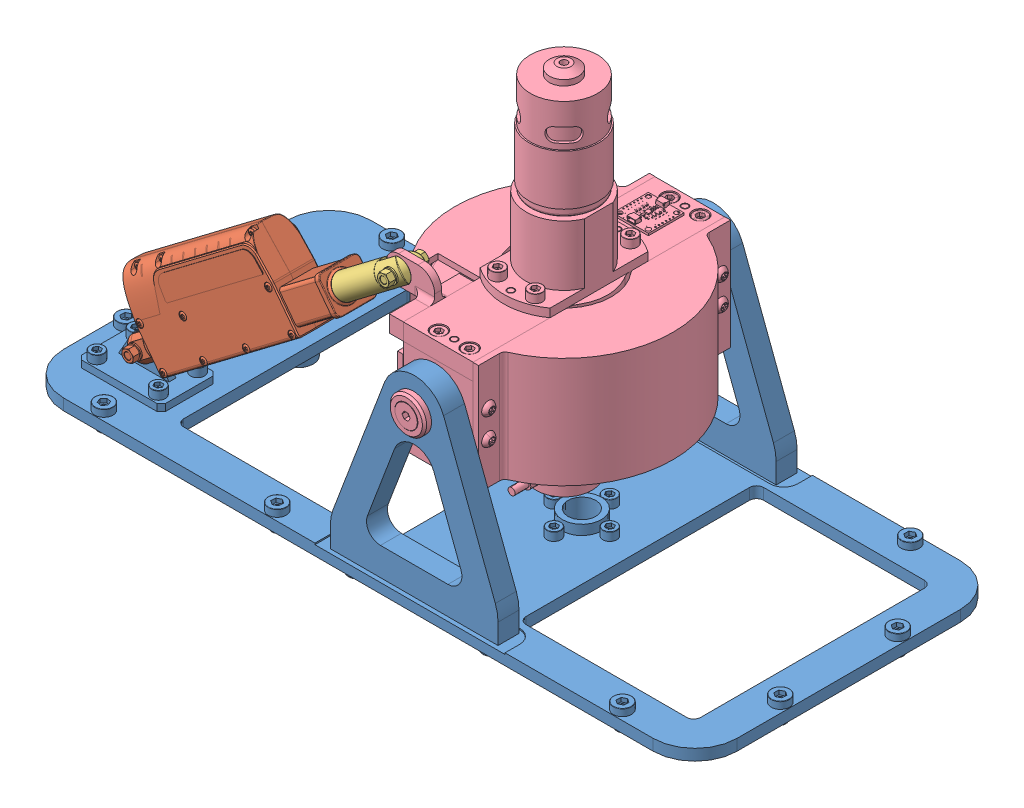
SolidWorks assembly Orientation_Cadre_Meca3D.SLDASM, configuration Défaut (file format 12000). Lengths in mm.
Overall size (482 319.97 222.75).
4 component instances, 4 part files, 7 mates.
Components (placement in the parent):
- structure-1: structure.SLDPRT [Défaut] at (-75.8614 -127.248 482) size (482 166.2 220)
- corps_verin-1: corps_verin.SLDPRT [Défaut] at (-218.5475 -47.7798 546.85) x (0.60348 -0.797378 0) z (-0.797378 -0.60348 0) size (61.61 33.46 185.99)
- tige_verin-1: tige_verin.SLDPRT [Défaut] at (-192.2813 -45.0193 546.9) x (0 0 -1) z (-0.797378 -0.60348 0) size (29.4 20.4 138.61)
- cadre-1: cadre.SLDPRT [Défaut] at (-129.863 -92.9839 481.8) x (0.866272 -0.499573 0) z (0 0 1) size (188.27 236.73 220.75)
Mates (geometry in assembly coordinates):
- Coaxiale1: concentric aligned: cylinder of structure-1 through (-271.8614 -105.248 544.5) axis (0 0 1) radius 4; cylinder of corps_verin-1 through (-271.8614 -105.248 553.379) axis (0 0 1) radius 4
- Coïncidente1: coincident anti-aligned: plane of structure-1 through (-271.8614 -105.248 549.5) normal (0 0 1); plane of corps_verin-1 through (-256.924 -104.6029 549.5) normal (0 0 -1)
- Coaxiale2: concentric aligned: cylinder of corps_verin-1 through (-141.4964 -6.5837 546.9) axis (0.797378 0.60348 0) radius 8.5; cylinder of tige_verin-1 through (-184.3075 -38.9845 546.9) axis (0.797378 0.60348 0) radius 8.5
- Coaxiale3: concentric anti-aligned: cone of structure-1 through (-38.8614 -9.248 586.06) axis (0 0 1); cylinder of cadre-1 through (-38.8614 -9.248 553.2261) axis (0 0 -1) radius 8
- Coaxiale4: concentric aligned: cylinder of tige_verin-1 through (-88.8614 33.252 553.379) axis (0 0 1) radius 4; cylinder of cadre-1 through (-88.8614 33.252 544.3) axis (0 0 1) radius 4
- Coïncidente4: coincident anti-aligned: plane of tige_verin-1 through (-88.8614 33.252 544.3) normal (0 0 1); plane of cadre-1 through (-89.8614 31.752 544.3) normal (0 0 -1)
- Parallèle1: parallel anti-aligned: plane of structure-1 through (-75.8614 -123.248 482) normal (0 1 0); plane of cadre-1 through (-38.8614 -101.648 481.8) normal (0 -1 0)
